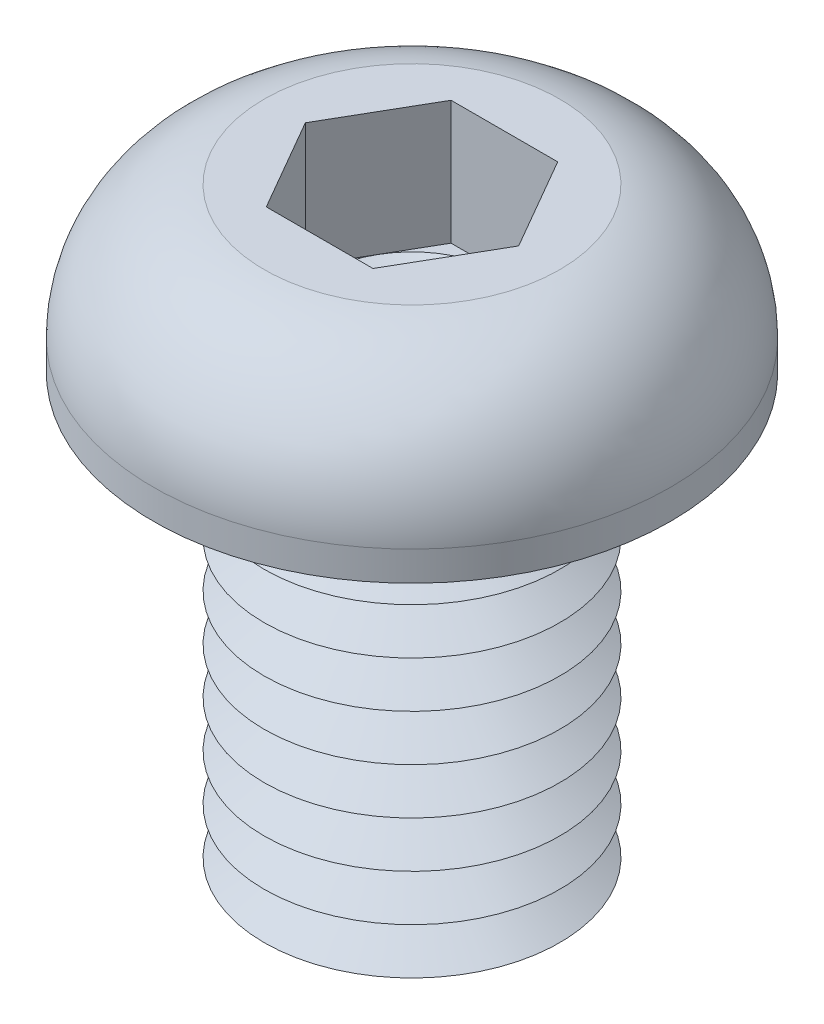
ISO-10303-21;
HEADER;
FILE_DESCRIPTION(('STEP AP214'),'2;1');
FILE_NAME('part.step','',(''),(''),'','','');
FILE_SCHEMA(('AUTOMOTIVE_DESIGN { 1 0 10303 214 1 1 1 1 }'));
ENDSEC;
DATA;
#1=APPLICATION_CONTEXT('core data for automotive mechanical design processes');
#2=APPLICATION_PROTOCOL_DEFINITION('international standard','automotive_design',2000,#1);
#3=PRODUCT_CONTEXT('',#1,'mechanical');
#4=PRODUCT('Part','Part','',(#3));
#5=PRODUCT_RELATED_PRODUCT_CATEGORY('part','',(#4));
#6=PRODUCT_DEFINITION_FORMATION('','',#4);
#7=PRODUCT_DEFINITION_CONTEXT('part definition',#1,'design');
#8=PRODUCT_DEFINITION('design','',#6,#7);
#9=PRODUCT_DEFINITION_SHAPE('','',#8);
#10=(LENGTH_UNIT() NAMED_UNIT(*) SI_UNIT(.MILLI.,.METRE.));
#11=(NAMED_UNIT(*) PLANE_ANGLE_UNIT() SI_UNIT($,.RADIAN.));
#12=(NAMED_UNIT(*) SI_UNIT($,.STERADIAN.) SOLID_ANGLE_UNIT());
#13=UNCERTAINTY_MEASURE_WITH_UNIT(LENGTH_MEASURE(1.E-05),#10,'distance_accuracy_value','');
#14=(GEOMETRIC_REPRESENTATION_CONTEXT(3) GLOBAL_UNCERTAINTY_ASSIGNED_CONTEXT((#13)) GLOBAL_UNIT_ASSIGNED_CONTEXT((#10,
#11,#12)) REPRESENTATION_CONTEXT('',''));
#15=CARTESIAN_POINT('',(0.,0.,0.));
#16=DIRECTION('',(0.,0.,1.));
#17=DIRECTION('',(1.,0.,0.));
#18=AXIS2_PLACEMENT_3D('',#15,#16,#17);
#19=CARTESIAN_POINT('',(0.,0.,0.));
#20=DIRECTION('',(0.,-1.,0.));
#21=DIRECTION('',(0.,0.,-1.));
#22=AXIS2_PLACEMENT_3D('',#19,#20,#21);
#23=TOROIDAL_SURFACE('',#22,4.625,0.625);
#24=CARTESIAN_POINT('',(0.,0.,-5.25));
#25=VERTEX_POINT('',#24);
#26=VERTEX_LOOP('',#25);
#27=FACE_BOUND('',#26,.T.);
#28=ADVANCED_FACE('P0_F12',(#27),#23,.T.);
#29=CLOSED_SHELL('',(#28));
#30=MANIFOLD_SOLID_BREP('P0_B1',#29);
#31=CARTESIAN_POINT('',(1.44337567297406,1.05,-2.5));
#32=DIRECTION('',(0.,1.,0.));
#33=DIRECTION('',(0.,0.,1.));
#34=AXIS2_PLACEMENT_3D('',#31,#32,#33);
#35=PLANE('',#34);
#36=CARTESIAN_POINT('',(0.,1.05,0.));
#37=DIRECTION('',(0.,1.,0.));
#38=DIRECTION('',(0.,0.,1.));
#39=AXIS2_PLACEMENT_3D('',#36,#37,#38);
#40=CIRCLE('',#39,2.5);
#41=CARTESIAN_POINT('',(0.,1.05,2.5));
#42=VERTEX_POINT('',#41);
#43=CARTESIAN_POINT('',(2.1650635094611,1.05,1.25));
#44=VERTEX_POINT('',#43);
#45=EDGE_CURVE('P1_E93',#42,#44,#40,.T.);
#46=ORIENTED_EDGE('',*,*,#45,.F.);
#47=DIRECTION('',(1.,0.,0.));
#48=VECTOR('',#47,1.);
#49=CARTESIAN_POINT('',(-1.44337567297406,1.05,2.5));
#50=LINE('',#49,#48);
#51=CARTESIAN_POINT('',(1.44337567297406,1.05,2.5));
#52=VERTEX_POINT('',#51);
#53=EDGE_CURVE('P1_E116',#42,#52,#50,.T.);
#54=ORIENTED_EDGE('',*,*,#53,.T.);
#55=DIRECTION('',(0.5,0.,-0.866025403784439));
#56=VECTOR('',#55,1.);
#57=CARTESIAN_POINT('',(1.44337567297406,1.05,2.5));
#58=LINE('',#57,#56);
#59=EDGE_CURVE('P1_E112',#52,#44,#58,.T.);
#60=ORIENTED_EDGE('',*,*,#59,.T.);
#61=EDGE_LOOP('',(#46,#54,#60));
#62=FACE_BOUND('',#61,.T.);
#63=ADVANCED_FACE('P1_F15',(#62),#35,.T.);
#64=CARTESIAN_POINT('',(0.,1.05,0.));
#65=DIRECTION('',(0.,1.,0.));
#66=DIRECTION('',(0.,0.,1.));
#67=AXIS2_PLACEMENT_3D('',#64,#65,#66);
#68=CIRCLE('',#67,2.5);
#69=CARTESIAN_POINT('',(2.1650635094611,1.05,-1.25));
#70=VERTEX_POINT('',#69);
#71=EDGE_CURVE('P1_E10',#44,#70,#68,.T.);
#72=ORIENTED_EDGE('',*,*,#71,.F.);
#73=CARTESIAN_POINT('',(2.88675134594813,1.05,0.));
#74=VERTEX_POINT('',#73);
#75=EDGE_CURVE('P1_E104',#44,#74,#58,.T.);
#76=ORIENTED_EDGE('',*,*,#75,.T.);
#77=DIRECTION('',(-0.5,0.,-0.866025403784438));
#78=VECTOR('',#77,1.);
#79=CARTESIAN_POINT('',(2.88675134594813,1.05,0.));
#80=LINE('',#79,#78);
#81=EDGE_CURVE('P1_E107',#74,#70,#80,.T.);
#82=ORIENTED_EDGE('',*,*,#81,.T.);
#83=EDGE_LOOP('',(#72,#76,#82));
#84=FACE_BOUND('',#83,.T.);
#85=ADVANCED_FACE('P1_F103',(#84),#35,.T.);
#86=CARTESIAN_POINT('',(0.,1.05,-2.5));
#87=VERTEX_POINT('',#86);
#88=EDGE_CURVE('P1_E24',#70,#87,#68,.T.);
#89=ORIENTED_EDGE('',*,*,#88,.F.);
#90=CARTESIAN_POINT('',(1.44337567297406,1.05,-2.5));
#91=VERTEX_POINT('',#90);
#92=EDGE_CURVE('P1_E139',#70,#91,#80,.T.);
#93=ORIENTED_EDGE('',*,*,#92,.T.);
#94=DIRECTION('',(-1.,0.,0.));
#95=VECTOR('',#94,1.);
#96=CARTESIAN_POINT('',(1.44337567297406,1.05,-2.5));
#97=LINE('',#96,#95);
#98=EDGE_CURVE('P1_E276',#91,#87,#97,.T.);
#99=ORIENTED_EDGE('',*,*,#98,.T.);
#100=EDGE_LOOP('',(#89,#93,#99));
#101=FACE_BOUND('',#100,.T.);
#102=ADVANCED_FACE('P1_F241',(#101),#35,.T.);
#103=CARTESIAN_POINT('',(-2.1650635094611,1.05,-1.25));
#104=VERTEX_POINT('',#103);
#105=EDGE_CURVE('P1_E271',#87,#104,#68,.T.);
#106=ORIENTED_EDGE('',*,*,#105,.F.);
#107=CARTESIAN_POINT('',(-1.44337567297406,1.05,-2.5));
#108=VERTEX_POINT('',#107);
#109=EDGE_CURVE('P1_E280',#87,#108,#97,.T.);
#110=ORIENTED_EDGE('',*,*,#109,.T.);
#111=DIRECTION('',(-0.5,0.,0.866025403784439));
#112=VECTOR('',#111,1.);
#113=CARTESIAN_POINT('',(-1.44337567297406,1.05,-2.5));
#114=LINE('',#113,#112);
#115=EDGE_CURVE('P1_E275',#108,#104,#114,.T.);
#116=ORIENTED_EDGE('',*,*,#115,.T.);
#117=EDGE_LOOP('',(#106,#110,#116));
#118=FACE_BOUND('',#117,.T.);
#119=ADVANCED_FACE('P1_F255',(#118),#35,.T.);
#120=CARTESIAN_POINT('',(-2.1650635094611,1.05,1.25));
#121=VERTEX_POINT('',#120);
#122=EDGE_CURVE('P1_E31',#104,#121,#68,.T.);
#123=ORIENTED_EDGE('',*,*,#122,.F.);
#124=CARTESIAN_POINT('',(-2.88675134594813,1.05,0.));
#125=VERTEX_POINT('',#124);
#126=EDGE_CURVE('P1_E267',#104,#125,#114,.T.);
#127=ORIENTED_EDGE('',*,*,#126,.T.);
#128=DIRECTION('',(0.5,0.,0.866025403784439));
#129=VECTOR('',#128,1.);
#130=CARTESIAN_POINT('',(-2.88675134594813,1.05,0.));
#131=LINE('',#130,#129);
#132=EDGE_CURVE('P1_E270',#125,#121,#131,.T.);
#133=ORIENTED_EDGE('',*,*,#132,.T.);
#134=EDGE_LOOP('',(#123,#127,#133));
#135=FACE_BOUND('',#134,.T.);
#136=ADVANCED_FACE('P1_F246',(#135),#35,.T.);
#137=CARTESIAN_POINT('',(0.,-10.75,0.));
#138=DIRECTION('',(0.,1.,0.));
#139=DIRECTION('',(0.,0.,1.));
#140=AXIS2_PLACEMENT_3D('',#137,#138,#139);
#141=CONICAL_SURFACE('',#140,2.91746824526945,1.0471975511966);
#142=CARTESIAN_POINT('',(0.,-10.125,0.));
#143=DIRECTION('',(0.,-1.,0.));
#144=DIRECTION('',(0.,0.,-1.));
#145=AXIS2_PLACEMENT_3D('',#142,#143,#144);
#146=CIRCLE('',#145,4.);
#147=CARTESIAN_POINT('',(0.,-10.125,-4.));
#148=VERTEX_POINT('',#147);
#149=EDGE_CURVE('P1_E203',#148,#148,#146,.T.);
#150=ORIENTED_EDGE('',*,*,#149,.T.);
#151=EDGE_LOOP('',(#150));
#152=FACE_BOUND('',#151,.T.);
#153=CARTESIAN_POINT('',(0.,-10.75,0.));
#154=DIRECTION('',(0.,-1.,0.));
#155=DIRECTION('',(0.,0.,-1.));
#156=AXIS2_PLACEMENT_3D('',#153,#154,#155);
#157=CIRCLE('',#156,2.91746824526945);
#158=CARTESIAN_POINT('',(0.,-10.75,-2.91746824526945));
#159=VERTEX_POINT('',#158);
#160=EDGE_CURVE('P1_E206',#159,#159,#157,.T.);
#161=ORIENTED_EDGE('',*,*,#160,.F.);
#162=EDGE_LOOP('',(#161));
#163=FACE_BOUND('',#162,.T.);
#164=ADVANCED_FACE('P1_F254',(#152,#163),#141,.T.);
#165=CARTESIAN_POINT('',(0.,-11.375,0.));
#166=DIRECTION('',(0.,-1.,0.));
#167=DIRECTION('',(0.,0.,-1.));
#168=AXIS2_PLACEMENT_3D('',#165,#166,#167);
#169=CONICAL_SURFACE('',#168,4.,1.0471975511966);
#170=ORIENTED_EDGE('',*,*,#160,.T.);
#171=EDGE_LOOP('',(#170));
#172=FACE_BOUND('',#171,.T.);
#173=CARTESIAN_POINT('',(0.,-11.375,0.));
#174=DIRECTION('',(0.,-1.,0.));
#175=DIRECTION('',(0.,0.,-1.));
#176=AXIS2_PLACEMENT_3D('',#173,#174,#175);
#177=CIRCLE('',#176,4.);
#178=CARTESIAN_POINT('',(0.,-11.375,-4.));
#179=VERTEX_POINT('',#178);
#180=EDGE_CURVE('P1_E209',#179,#179,#177,.T.);
#181=ORIENTED_EDGE('',*,*,#180,.F.);
#182=EDGE_LOOP('',(#181));
#183=FACE_BOUND('',#182,.T.);
#184=ADVANCED_FACE('P1_F261',(#172,#183),#169,.T.);
#185=CARTESIAN_POINT('',(0.,-12.,0.));
#186=DIRECTION('',(0.,1.,0.));
#187=DIRECTION('',(0.,0.,1.));
#188=AXIS2_PLACEMENT_3D('',#185,#186,#187);
#189=PLANE('',#188);
#190=CARTESIAN_POINT('',(0.,-12.,0.));
#191=DIRECTION('',(0.,-1.,0.));
#192=DIRECTION('',(0.,0.,-1.));
#193=AXIS2_PLACEMENT_3D('',#190,#191,#192);
#194=CIRCLE('',#193,2.91746824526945);
#195=CARTESIAN_POINT('',(0.,-12.,-2.91746824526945));
#196=VERTEX_POINT('',#195);
#197=EDGE_CURVE('P1_E212',#196,#196,#194,.T.);
#198=ORIENTED_EDGE('',*,*,#197,.T.);
#199=EDGE_LOOP('',(#198));
#200=FACE_BOUND('',#199,.T.);
#201=ADVANCED_FACE('P1_F339',(#200),#189,.F.);
#202=CARTESIAN_POINT('',(0.,-12.,0.));
#203=DIRECTION('',(0.,1.,0.));
#204=DIRECTION('',(0.,0.,1.));
#205=AXIS2_PLACEMENT_3D('',#202,#203,#204);
#206=CONICAL_SURFACE('',#205,2.91746824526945,1.0471975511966);
#207=ORIENTED_EDGE('',*,*,#180,.T.);
#208=EDGE_LOOP('',(#207));
#209=FACE_BOUND('',#208,.T.);
#210=ORIENTED_EDGE('',*,*,#197,.F.);
#211=EDGE_LOOP('',(#210));
#212=FACE_BOUND('',#211,.T.);
#213=ADVANCED_FACE('P1_F350',(#209,#212),#206,.T.);
#214=CARTESIAN_POINT('',(0.,-9.5,0.));
#215=DIRECTION('',(0.,1.,0.));
#216=DIRECTION('',(0.,0.,1.));
#217=AXIS2_PLACEMENT_3D('',#214,#215,#216);
#218=CONICAL_SURFACE('',#217,2.91746824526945,1.0471975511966);
#219=CARTESIAN_POINT('',(0.,-8.875,0.));
#220=DIRECTION('',(0.,-1.,0.));
#221=DIRECTION('',(0.,0.,-1.));
#222=AXIS2_PLACEMENT_3D('',#219,#220,#221);
#223=CIRCLE('',#222,4.);
#224=CARTESIAN_POINT('',(0.,-8.875,-4.));
#225=VERTEX_POINT('',#224);
#226=EDGE_CURVE('P1_E197',#225,#225,#223,.T.);
#227=ORIENTED_EDGE('',*,*,#226,.T.);
#228=EDGE_LOOP('',(#227));
#229=FACE_BOUND('',#228,.T.);
#230=CARTESIAN_POINT('',(0.,-9.5,0.));
#231=DIRECTION('',(0.,-1.,0.));
#232=DIRECTION('',(0.,0.,-1.));
#233=AXIS2_PLACEMENT_3D('',#230,#231,#232);
#234=CIRCLE('',#233,2.91746824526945);
#235=CARTESIAN_POINT('',(0.,-9.5,-2.91746824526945));
#236=VERTEX_POINT('',#235);
#237=EDGE_CURVE('P1_E200',#236,#236,#234,.T.);
#238=ORIENTED_EDGE('',*,*,#237,.F.);
#239=EDGE_LOOP('',(#238));
#240=FACE_BOUND('',#239,.T.);
#241=ADVANCED_FACE('P1_F359',(#229,#240),#218,.T.);
#242=CARTESIAN_POINT('',(0.,-10.125,0.));
#243=DIRECTION('',(0.,-1.,0.));
#244=DIRECTION('',(0.,0.,-1.));
#245=AXIS2_PLACEMENT_3D('',#242,#243,#244);
#246=CONICAL_SURFACE('',#245,4.,1.0471975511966);
#247=ORIENTED_EDGE('',*,*,#237,.T.);
#248=EDGE_LOOP('',(#247));
#249=FACE_BOUND('',#248,.T.);
#250=ORIENTED_EDGE('',*,*,#149,.F.);
#251=EDGE_LOOP('',(#250));
#252=FACE_BOUND('',#251,.T.);
#253=ADVANCED_FACE('P1_F368',(#249,#252),#246,.T.);
#254=CARTESIAN_POINT('',(0.,-8.25,0.));
#255=DIRECTION('',(0.,1.,0.));
#256=DIRECTION('',(0.,0.,1.));
#257=AXIS2_PLACEMENT_3D('',#254,#255,#256);
#258=CONICAL_SURFACE('',#257,2.91746824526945,1.0471975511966);
#259=CARTESIAN_POINT('',(0.,-7.625,0.));
#260=DIRECTION('',(0.,-1.,0.));
#261=DIRECTION('',(0.,0.,-1.));
#262=AXIS2_PLACEMENT_3D('',#259,#260,#261);
#263=CIRCLE('',#262,4.);
#264=CARTESIAN_POINT('',(0.,-7.625,-4.));
#265=VERTEX_POINT('',#264);
#266=EDGE_CURVE('P1_E191',#265,#265,#263,.T.);
#267=ORIENTED_EDGE('',*,*,#266,.T.);
#268=EDGE_LOOP('',(#267));
#269=FACE_BOUND('',#268,.T.);
#270=CARTESIAN_POINT('',(0.,-8.25,0.));
#271=DIRECTION('',(0.,-1.,0.));
#272=DIRECTION('',(0.,0.,-1.));
#273=AXIS2_PLACEMENT_3D('',#270,#271,#272);
#274=CIRCLE('',#273,2.91746824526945);
#275=CARTESIAN_POINT('',(0.,-8.25,-2.91746824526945));
#276=VERTEX_POINT('',#275);
#277=EDGE_CURVE('P1_E194',#276,#276,#274,.T.);
#278=ORIENTED_EDGE('',*,*,#277,.F.);
#279=EDGE_LOOP('',(#278));
#280=FACE_BOUND('',#279,.T.);
#281=ADVANCED_FACE('P1_F378',(#269,#280),#258,.T.);
#282=CARTESIAN_POINT('',(0.,-8.875,0.));
#283=DIRECTION('',(0.,-1.,0.));
#284=DIRECTION('',(0.,0.,-1.));
#285=AXIS2_PLACEMENT_3D('',#282,#283,#284);
#286=CONICAL_SURFACE('',#285,4.,1.0471975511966);
#287=ORIENTED_EDGE('',*,*,#277,.T.);
#288=EDGE_LOOP('',(#287));
#289=FACE_BOUND('',#288,.T.);
#290=ORIENTED_EDGE('',*,*,#226,.F.);
#291=EDGE_LOOP('',(#290));
#292=FACE_BOUND('',#291,.T.);
#293=ADVANCED_FACE('P1_F388',(#289,#292),#286,.T.);
#294=CARTESIAN_POINT('',(0.,-7.,0.));
#295=DIRECTION('',(0.,1.,0.));
#296=DIRECTION('',(0.,0.,1.));
#297=AXIS2_PLACEMENT_3D('',#294,#295,#296);
#298=CONICAL_SURFACE('',#297,2.91746824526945,1.0471975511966);
#299=CARTESIAN_POINT('',(0.,-6.375,0.));
#300=DIRECTION('',(0.,-1.,0.));
#301=DIRECTION('',(0.,0.,-1.));
#302=AXIS2_PLACEMENT_3D('',#299,#300,#301);
#303=CIRCLE('',#302,4.);
#304=CARTESIAN_POINT('',(0.,-6.375,-4.));
#305=VERTEX_POINT('',#304);
#306=EDGE_CURVE('P1_E185',#305,#305,#303,.T.);
#307=ORIENTED_EDGE('',*,*,#306,.T.);
#308=EDGE_LOOP('',(#307));
#309=FACE_BOUND('',#308,.T.);
#310=CARTESIAN_POINT('',(0.,-7.,0.));
#311=DIRECTION('',(0.,-1.,0.));
#312=DIRECTION('',(0.,0.,-1.));
#313=AXIS2_PLACEMENT_3D('',#310,#311,#312);
#314=CIRCLE('',#313,2.91746824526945);
#315=CARTESIAN_POINT('',(0.,-7.,-2.91746824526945));
#316=VERTEX_POINT('',#315);
#317=EDGE_CURVE('P1_E188',#316,#316,#314,.T.);
#318=ORIENTED_EDGE('',*,*,#317,.F.);
#319=EDGE_LOOP('',(#318));
#320=FACE_BOUND('',#319,.T.);
#321=ADVANCED_FACE('P1_F398',(#309,#320),#298,.T.);
#322=CARTESIAN_POINT('',(0.,-7.625,0.));
#323=DIRECTION('',(0.,-1.,0.));
#324=DIRECTION('',(0.,0.,-1.));
#325=AXIS2_PLACEMENT_3D('',#322,#323,#324);
#326=CONICAL_SURFACE('',#325,4.,1.0471975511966);
#327=ORIENTED_EDGE('',*,*,#317,.T.);
#328=EDGE_LOOP('',(#327));
#329=FACE_BOUND('',#328,.T.);
#330=ORIENTED_EDGE('',*,*,#266,.F.);
#331=EDGE_LOOP('',(#330));
#332=FACE_BOUND('',#331,.T.);
#333=ADVANCED_FACE('P1_F408',(#329,#332),#326,.T.);
#334=CARTESIAN_POINT('',(0.,-5.75,0.));
#335=DIRECTION('',(0.,1.,0.));
#336=DIRECTION('',(0.,0.,1.));
#337=AXIS2_PLACEMENT_3D('',#334,#335,#336);
#338=CONICAL_SURFACE('',#337,2.91746824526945,1.0471975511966);
#339=CARTESIAN_POINT('',(0.,-5.125,0.));
#340=DIRECTION('',(0.,-1.,0.));
#341=DIRECTION('',(0.,0.,-1.));
#342=AXIS2_PLACEMENT_3D('',#339,#340,#341);
#343=CIRCLE('',#342,4.);
#344=CARTESIAN_POINT('',(0.,-5.125,-4.));
#345=VERTEX_POINT('',#344);
#346=EDGE_CURVE('P1_E179',#345,#345,#343,.T.);
#347=ORIENTED_EDGE('',*,*,#346,.T.);
#348=EDGE_LOOP('',(#347));
#349=FACE_BOUND('',#348,.T.);
#350=CARTESIAN_POINT('',(0.,-5.75,0.));
#351=DIRECTION('',(0.,-1.,0.));
#352=DIRECTION('',(0.,0.,-1.));
#353=AXIS2_PLACEMENT_3D('',#350,#351,#352);
#354=CIRCLE('',#353,2.91746824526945);
#355=CARTESIAN_POINT('',(0.,-5.75,-2.91746824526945));
#356=VERTEX_POINT('',#355);
#357=EDGE_CURVE('P1_E182',#356,#356,#354,.T.);
#358=ORIENTED_EDGE('',*,*,#357,.F.);
#359=EDGE_LOOP('',(#358));
#360=FACE_BOUND('',#359,.T.);
#361=ADVANCED_FACE('P1_F418',(#349,#360),#338,.T.);
#362=CARTESIAN_POINT('',(0.,-6.375,0.));
#363=DIRECTION('',(0.,-1.,0.));
#364=DIRECTION('',(0.,0.,-1.));
#365=AXIS2_PLACEMENT_3D('',#362,#363,#364);
#366=CONICAL_SURFACE('',#365,4.,1.0471975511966);
#367=ORIENTED_EDGE('',*,*,#357,.T.);
#368=EDGE_LOOP('',(#367));
#369=FACE_BOUND('',#368,.T.);
#370=ORIENTED_EDGE('',*,*,#306,.F.);
#371=EDGE_LOOP('',(#370));
#372=FACE_BOUND('',#371,.T.);
#373=ADVANCED_FACE('P1_F428',(#369,#372),#366,.T.);
#374=CARTESIAN_POINT('',(0.,-4.5,0.));
#375=DIRECTION('',(0.,1.,0.));
#376=DIRECTION('',(0.,0.,1.));
#377=AXIS2_PLACEMENT_3D('',#374,#375,#376);
#378=CONICAL_SURFACE('',#377,2.91746824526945,1.0471975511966);
#379=CARTESIAN_POINT('',(0.,-3.875,0.));
#380=DIRECTION('',(0.,-1.,0.));
#381=DIRECTION('',(0.,0.,-1.));
#382=AXIS2_PLACEMENT_3D('',#379,#380,#381);
#383=CIRCLE('',#382,4.);
#384=CARTESIAN_POINT('',(0.,-3.875,-4.));
#385=VERTEX_POINT('',#384);
#386=EDGE_CURVE('P1_E173',#385,#385,#383,.T.);
#387=ORIENTED_EDGE('',*,*,#386,.T.);
#388=EDGE_LOOP('',(#387));
#389=FACE_BOUND('',#388,.T.);
#390=CARTESIAN_POINT('',(0.,-4.5,0.));
#391=DIRECTION('',(0.,-1.,0.));
#392=DIRECTION('',(0.,0.,-1.));
#393=AXIS2_PLACEMENT_3D('',#390,#391,#392);
#394=CIRCLE('',#393,2.91746824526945);
#395=CARTESIAN_POINT('',(0.,-4.5,-2.91746824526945));
#396=VERTEX_POINT('',#395);
#397=EDGE_CURVE('P1_E176',#396,#396,#394,.T.);
#398=ORIENTED_EDGE('',*,*,#397,.F.);
#399=EDGE_LOOP('',(#398));
#400=FACE_BOUND('',#399,.T.);
#401=ADVANCED_FACE('P1_F438',(#389,#400),#378,.T.);
#402=CARTESIAN_POINT('',(0.,-5.125,0.));
#403=DIRECTION('',(0.,-1.,0.));
#404=DIRECTION('',(0.,0.,-1.));
#405=AXIS2_PLACEMENT_3D('',#402,#403,#404);
#406=CONICAL_SURFACE('',#405,4.,1.0471975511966);
#407=ORIENTED_EDGE('',*,*,#397,.T.);
#408=EDGE_LOOP('',(#407));
#409=FACE_BOUND('',#408,.T.);
#410=ORIENTED_EDGE('',*,*,#346,.F.);
#411=EDGE_LOOP('',(#410));
#412=FACE_BOUND('',#411,.T.);
#413=ADVANCED_FACE('P1_F448',(#409,#412),#406,.T.);
#414=CARTESIAN_POINT('',(0.,-3.25,0.));
#415=DIRECTION('',(0.,1.,0.));
#416=DIRECTION('',(0.,0.,1.));
#417=AXIS2_PLACEMENT_3D('',#414,#415,#416);
#418=CONICAL_SURFACE('',#417,2.91746824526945,1.0471975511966);
#419=CARTESIAN_POINT('',(0.,-2.625,0.));
#420=DIRECTION('',(0.,-1.,0.));
#421=DIRECTION('',(0.,0.,-1.));
#422=AXIS2_PLACEMENT_3D('',#419,#420,#421);
#423=CIRCLE('',#422,4.);
#424=CARTESIAN_POINT('',(0.,-2.625,-4.));
#425=VERTEX_POINT('',#424);
#426=EDGE_CURVE('P1_E164',#425,#425,#423,.T.);
#427=ORIENTED_EDGE('',*,*,#426,.T.);
#428=EDGE_LOOP('',(#427));
#429=FACE_BOUND('',#428,.T.);
#430=CARTESIAN_POINT('',(0.,-3.25,0.));
#431=DIRECTION('',(0.,-1.,0.));
#432=DIRECTION('',(0.,0.,-1.));
#433=AXIS2_PLACEMENT_3D('',#430,#431,#432);
#434=CIRCLE('',#433,2.91746824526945);
#435=CARTESIAN_POINT('',(0.,-3.25,-2.91746824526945));
#436=VERTEX_POINT('',#435);
#437=EDGE_CURVE('P1_E170',#436,#436,#434,.T.);
#438=ORIENTED_EDGE('',*,*,#437,.F.);
#439=EDGE_LOOP('',(#438));
#440=FACE_BOUND('',#439,.T.);
#441=ADVANCED_FACE('P1_F458',(#429,#440),#418,.T.);
#442=CARTESIAN_POINT('',(0.,-3.875,0.));
#443=DIRECTION('',(0.,-1.,0.));
#444=DIRECTION('',(0.,0.,-1.));
#445=AXIS2_PLACEMENT_3D('',#442,#443,#444);
#446=CONICAL_SURFACE('',#445,4.,1.0471975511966);
#447=ORIENTED_EDGE('',*,*,#437,.T.);
#448=EDGE_LOOP('',(#447));
#449=FACE_BOUND('',#448,.T.);
#450=ORIENTED_EDGE('',*,*,#386,.F.);
#451=EDGE_LOOP('',(#450));
#452=FACE_BOUND('',#451,.T.);
#453=ADVANCED_FACE('P1_F468',(#449,#452),#446,.T.);
#454=CARTESIAN_POINT('',(0.,-2.,0.));
#455=DIRECTION('',(0.,1.,0.));
#456=DIRECTION('',(0.,0.,1.));
#457=AXIS2_PLACEMENT_3D('',#454,#455,#456);
#458=CONICAL_SURFACE('',#457,2.91746824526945,1.0471975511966);
#459=CARTESIAN_POINT('',(0.,-1.375,0.));
#460=DIRECTION('',(0.,-1.,0.));
#461=DIRECTION('',(0.,0.,-1.));
#462=AXIS2_PLACEMENT_3D('',#459,#460,#461);
#463=CIRCLE('',#462,4.);
#464=CARTESIAN_POINT('',(0.,-1.375,-4.));
#465=VERTEX_POINT('',#464);
#466=EDGE_CURVE('P1_E167',#465,#465,#463,.T.);
#467=ORIENTED_EDGE('',*,*,#466,.T.);
#468=EDGE_LOOP('',(#467));
#469=FACE_BOUND('',#468,.T.);
#470=CARTESIAN_POINT('',(0.,-2.,0.));
#471=DIRECTION('',(0.,-1.,0.));
#472=DIRECTION('',(0.,0.,-1.));
#473=AXIS2_PLACEMENT_3D('',#470,#471,#472);
#474=CIRCLE('',#473,2.91746824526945);
#475=CARTESIAN_POINT('',(0.,-2.,-2.91746824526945));
#476=VERTEX_POINT('',#475);
#477=EDGE_CURVE('P1_E161',#476,#476,#474,.T.);
#478=ORIENTED_EDGE('',*,*,#477,.F.);
#479=EDGE_LOOP('',(#478));
#480=FACE_BOUND('',#479,.T.);
#481=ADVANCED_FACE('P1_F478',(#469,#480),#458,.T.);
#482=CARTESIAN_POINT('',(0.,-2.625,0.));
#483=DIRECTION('',(0.,-1.,0.));
#484=DIRECTION('',(0.,0.,-1.));
#485=AXIS2_PLACEMENT_3D('',#482,#483,#484);
#486=CONICAL_SURFACE('',#485,4.,1.0471975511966);
#487=ORIENTED_EDGE('',*,*,#477,.T.);
#488=EDGE_LOOP('',(#487));
#489=FACE_BOUND('',#488,.T.);
#490=ORIENTED_EDGE('',*,*,#426,.F.);
#491=EDGE_LOOP('',(#490));
#492=FACE_BOUND('',#491,.T.);
#493=ADVANCED_FACE('P1_F488',(#489,#492),#486,.T.);
#494=CARTESIAN_POINT('',(0.,-12.,0.));
#495=DIRECTION('',(0.,1.,0.));
#496=DIRECTION('',(0.,0.,1.));
#497=AXIS2_PLACEMENT_3D('',#494,#495,#496);
#498=CYLINDRICAL_SURFACE('',#497,4.);
#499=CARTESIAN_POINT('',(0.,0.,0.));
#500=DIRECTION('',(0.,-1.,0.));
#501=DIRECTION('',(1.,0.,0.));
#502=AXIS2_PLACEMENT_3D('',#499,#500,#501);
#503=CIRCLE('',#502,4.);
#504=CARTESIAN_POINT('',(4.,0.,0.));
#505=VERTEX_POINT('',#504);
#506=EDGE_CURVE('P1_E141',#505,#505,#503,.F.);
#507=ORIENTED_EDGE('',*,*,#506,.F.);
#508=EDGE_LOOP('',(#507));
#509=FACE_BOUND('',#508,.T.);
#510=ORIENTED_EDGE('',*,*,#466,.F.);
#511=EDGE_LOOP('',(#510));
#512=FACE_BOUND('',#511,.T.);
#513=ADVANCED_FACE('P1_F17',(#509,#512),#498,.T.);
#514=CARTESIAN_POINT('',(0.,0.,0.));
#515=DIRECTION('',(0.,-1.,0.));
#516=DIRECTION('',(0.,0.,-1.));
#517=AXIS2_PLACEMENT_3D('',#514,#515,#516);
#518=TOROIDAL_SURFACE('',#517,4.625,0.625);
#519=ORIENTED_EDGE('',*,*,#506,.T.);
#520=EDGE_LOOP('',(#519));
#521=FACE_BOUND('',#520,.T.);
#522=CARTESIAN_POINT('',(0.,0.,0.));
#523=DIRECTION('',(0.,1.,0.));
#524=DIRECTION('',(-1.,0.,0.));
#525=AXIS2_PLACEMENT_3D('',#522,#523,#524);
#526=CIRCLE('',#525,5.25);
#527=CARTESIAN_POINT('',(-5.25,0.,0.));
#528=VERTEX_POINT('',#527);
#529=EDGE_CURVE('P1_E151',#528,#528,#526,.F.);
#530=ORIENTED_EDGE('',*,*,#529,.T.);
#531=EDGE_LOOP('',(#530));
#532=FACE_BOUND('',#531,.T.);
#533=ADVANCED_FACE('P1_F217',(#521,#532),#518,.F.);
#534=CARTESIAN_POINT('',(4.,4.4,0.));
#535=DIRECTION('',(0.,-1.,0.));
#536=DIRECTION('',(1.,0.,0.));
#537=AXIS2_PLACEMENT_3D('',#534,#535,#536);
#538=PLANE('',#537);
#539=DIRECTION('',(-1.,0.,0.));
#540=VECTOR('',#539,1.);
#541=CARTESIAN_POINT('',(1.44337567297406,4.4,-2.5));
#542=LINE('',#541,#540);
#543=CARTESIAN_POINT('',(1.44337567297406,4.4,-2.5));
#544=VERTEX_POINT('',#543);
#545=CARTESIAN_POINT('',(-1.44337567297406,4.4,-2.5));
#546=VERTEX_POINT('',#545);
#547=EDGE_CURVE('P1_E125',#544,#546,#542,.T.);
#548=ORIENTED_EDGE('',*,*,#547,.F.);
#549=DIRECTION('',(-0.5,0.,-0.866025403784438));
#550=VECTOR('',#549,1.);
#551=CARTESIAN_POINT('',(2.88675134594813,4.4,0.));
#552=LINE('',#551,#550);
#553=CARTESIAN_POINT('',(2.88675134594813,4.4,0.));
#554=VERTEX_POINT('',#553);
#555=EDGE_CURVE('P1_E39',#554,#544,#552,.T.);
#556=ORIENTED_EDGE('',*,*,#555,.F.);
#557=DIRECTION('',(0.5,0.,-0.866025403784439));
#558=VECTOR('',#557,1.);
#559=CARTESIAN_POINT('',(1.44337567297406,4.4,2.5));
#560=LINE('',#559,#558);
#561=CARTESIAN_POINT('',(1.44337567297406,4.4,2.5));
#562=VERTEX_POINT('',#561);
#563=EDGE_CURVE('P1_E137',#562,#554,#560,.T.);
#564=ORIENTED_EDGE('',*,*,#563,.F.);
#565=DIRECTION('',(1.,0.,0.));
#566=VECTOR('',#565,1.);
#567=CARTESIAN_POINT('',(-1.44337567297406,4.4,2.5));
#568=LINE('',#567,#566);
#569=CARTESIAN_POINT('',(-1.44337567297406,4.4,2.5));
#570=VERTEX_POINT('',#569);
#571=EDGE_CURVE('P1_E134',#570,#562,#568,.T.);
#572=ORIENTED_EDGE('',*,*,#571,.F.);
#573=DIRECTION('',(0.5,0.,0.866025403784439));
#574=VECTOR('',#573,1.);
#575=CARTESIAN_POINT('',(-2.88675134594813,4.4,0.));
#576=LINE('',#575,#574);
#577=CARTESIAN_POINT('',(-2.88675134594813,4.4,0.));
#578=VERTEX_POINT('',#577);
#579=EDGE_CURVE('P1_E131',#578,#570,#576,.T.);
#580=ORIENTED_EDGE('',*,*,#579,.F.);
#581=DIRECTION('',(-0.5,0.,0.866025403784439));
#582=VECTOR('',#581,1.);
#583=CARTESIAN_POINT('',(-1.44337567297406,4.4,-2.5));
#584=LINE('',#583,#582);
#585=EDGE_CURVE('P1_E128',#546,#578,#584,.T.);
#586=ORIENTED_EDGE('',*,*,#585,.F.);
#587=EDGE_LOOP('',(#548,#556,#564,#572,#580,#586));
#588=FACE_BOUND('',#587,.T.);
#589=CARTESIAN_POINT('',(0.,4.4,0.));
#590=DIRECTION('',(0.,1.,0.));
#591=DIRECTION('',(-1.,0.,0.));
#592=AXIS2_PLACEMENT_3D('',#589,#590,#591);
#593=CIRCLE('',#592,4.);
#594=CARTESIAN_POINT('',(-4.,4.4,0.));
#595=VERTEX_POINT('',#594);
#596=EDGE_CURVE('P1_E152',#595,#595,#593,.T.);
#597=ORIENTED_EDGE('',*,*,#596,.T.);
#598=EDGE_LOOP('',(#597));
#599=FACE_BOUND('',#598,.T.);
#600=ADVANCED_FACE('P1_F295',(#588,#599),#538,.F.);
#601=CARTESIAN_POINT('',(0.,0.8,0.));
#602=DIRECTION('',(0.,1.,0.));
#603=DIRECTION('',(-1.,0.,0.));
#604=AXIS2_PLACEMENT_3D('',#601,#602,#603);
#605=DEGENERATE_TOROIDAL_SURFACE('',#604,3.34,3.66,.T.);
#606=ORIENTED_EDGE('',*,*,#596,.F.);
#607=EDGE_LOOP('',(#606));
#608=FACE_BOUND('',#607,.T.);
#609=CARTESIAN_POINT('',(0.,0.799999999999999,0.));
#610=DIRECTION('',(0.,1.,0.));
#611=DIRECTION('',(-1.,0.,0.));
#612=AXIS2_PLACEMENT_3D('',#609,#610,#611);
#613=CIRCLE('',#612,7.);
#614=CARTESIAN_POINT('',(-7.,0.799999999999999,0.));
#615=VERTEX_POINT('',#614);
#616=EDGE_CURVE('P1_E155',#615,#615,#613,.T.);
#617=ORIENTED_EDGE('',*,*,#616,.T.);
#618=EDGE_LOOP('',(#617));
#619=FACE_BOUND('',#618,.T.);
#620=ADVANCED_FACE('P1_F231',(#608,#619),#605,.T.);
#621=CARTESIAN_POINT('',(0.,4.4,0.));
#622=DIRECTION('',(0.,1.,0.));
#623=DIRECTION('',(-1.,0.,0.));
#624=AXIS2_PLACEMENT_3D('',#621,#622,#623);
#625=CYLINDRICAL_SURFACE('',#624,7.);
#626=ORIENTED_EDGE('',*,*,#616,.F.);
#627=EDGE_LOOP('',(#626));
#628=FACE_BOUND('',#627,.T.);
#629=CARTESIAN_POINT('',(0.,0.,0.));
#630=DIRECTION('',(0.,1.,0.));
#631=DIRECTION('',(-1.,0.,0.));
#632=AXIS2_PLACEMENT_3D('',#629,#630,#631);
#633=CIRCLE('',#632,7.);
#634=CARTESIAN_POINT('',(-7.,0.,0.));
#635=VERTEX_POINT('',#634);
#636=EDGE_CURVE('P1_E158',#635,#635,#633,.T.);
#637=ORIENTED_EDGE('',*,*,#636,.T.);
#638=EDGE_LOOP('',(#637));
#639=FACE_BOUND('',#638,.T.);
#640=ADVANCED_FACE('P1_F222',(#628,#639),#625,.T.);
#641=CARTESIAN_POINT('',(0.,0.,0.));
#642=DIRECTION('',(0.,1.,0.));
#643=DIRECTION('',(-1.,0.,0.));
#644=AXIS2_PLACEMENT_3D('',#641,#642,#643);
#645=PLANE('',#644);
#646=ORIENTED_EDGE('',*,*,#636,.F.);
#647=EDGE_LOOP('',(#646));
#648=FACE_BOUND('',#647,.T.);
#649=ORIENTED_EDGE('',*,*,#529,.F.);
#650=EDGE_LOOP('',(#649));
#651=FACE_BOUND('',#650,.T.);
#652=ADVANCED_FACE('P1_F219',(#648,#651),#645,.F.);
#653=CARTESIAN_POINT('',(2.88675134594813,1.05,0.));
#654=DIRECTION('',(0.866025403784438,0.,-0.5));
#655=DIRECTION('',(-0.5,0.,-0.866025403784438));
#656=AXIS2_PLACEMENT_3D('',#653,#654,#655);
#657=PLANE('',#656);
#658=ORIENTED_EDGE('',*,*,#555,.T.);
#659=DIRECTION('',(0.,1.,0.));
#660=VECTOR('',#659,1.);
#661=CARTESIAN_POINT('',(1.44337567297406,1.05,-2.5));
#662=LINE('',#661,#660);
#663=EDGE_CURVE('P1_E118',#91,#544,#662,.T.);
#664=ORIENTED_EDGE('',*,*,#663,.F.);
#665=ORIENTED_EDGE('',*,*,#92,.F.);
#666=ORIENTED_EDGE('',*,*,#81,.F.);
#667=DIRECTION('',(0.,1.,0.));
#668=VECTOR('',#667,1.);
#669=CARTESIAN_POINT('',(2.88675134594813,1.05,0.));
#670=LINE('',#669,#668);
#671=EDGE_CURVE('P1_E113',#74,#554,#670,.T.);
#672=ORIENTED_EDGE('',*,*,#671,.T.);
#673=EDGE_LOOP('',(#658,#664,#665,#666,#672));
#674=FACE_BOUND('',#673,.T.);
#675=ADVANCED_FACE('P1_F221',(#674),#657,.F.);
#676=CARTESIAN_POINT('',(1.44337567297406,1.05,2.5));
#677=DIRECTION('',(0.866025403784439,0.,0.5));
#678=DIRECTION('',(0.5,0.,-0.866025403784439));
#679=AXIS2_PLACEMENT_3D('',#676,#677,#678);
#680=PLANE('',#679);
#681=ORIENTED_EDGE('',*,*,#563,.T.);
#682=ORIENTED_EDGE('',*,*,#671,.F.);
#683=ORIENTED_EDGE('',*,*,#75,.F.);
#684=ORIENTED_EDGE('',*,*,#59,.F.);
#685=DIRECTION('',(0.,1.,0.));
#686=VECTOR('',#685,1.);
#687=CARTESIAN_POINT('',(1.44337567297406,1.05,2.5));
#688=LINE('',#687,#686);
#689=EDGE_CURVE('P1_E142',#52,#562,#688,.T.);
#690=ORIENTED_EDGE('',*,*,#689,.T.);
#691=EDGE_LOOP('',(#681,#682,#683,#684,#690));
#692=FACE_BOUND('',#691,.T.);
#693=ADVANCED_FACE('P1_F111',(#692),#680,.F.);
#694=CARTESIAN_POINT('',(-1.44337567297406,1.05,2.5));
#695=DIRECTION('',(0.,0.,1.));
#696=DIRECTION('',(1.,0.,0.));
#697=AXIS2_PLACEMENT_3D('',#694,#695,#696);
#698=PLANE('',#697);
#699=ORIENTED_EDGE('',*,*,#571,.T.);
#700=ORIENTED_EDGE('',*,*,#689,.F.);
#701=ORIENTED_EDGE('',*,*,#53,.F.);
#702=CARTESIAN_POINT('',(-1.44337567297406,1.05,2.5));
#703=VERTEX_POINT('',#702);
#704=EDGE_CURVE('P1_E114',#703,#42,#50,.T.);
#705=ORIENTED_EDGE('',*,*,#704,.F.);
#706=DIRECTION('',(0.,1.,0.));
#707=VECTOR('',#706,1.);
#708=CARTESIAN_POINT('',(-1.44337567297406,1.05,2.5));
#709=LINE('',#708,#707);
#710=EDGE_CURVE('P1_E144',#703,#570,#709,.T.);
#711=ORIENTED_EDGE('',*,*,#710,.T.);
#712=EDGE_LOOP('',(#699,#700,#701,#705,#711));
#713=FACE_BOUND('',#712,.T.);
#714=ADVANCED_FACE('P1_F290',(#713),#698,.F.);
#715=CARTESIAN_POINT('',(-2.88675134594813,1.05,0.));
#716=DIRECTION('',(-0.866025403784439,0.,0.5));
#717=DIRECTION('',(0.5,0.,0.866025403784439));
#718=AXIS2_PLACEMENT_3D('',#715,#716,#717);
#719=PLANE('',#718);
#720=ORIENTED_EDGE('',*,*,#579,.T.);
#721=ORIENTED_EDGE('',*,*,#710,.F.);
#722=EDGE_CURVE('P1_E282',#121,#703,#131,.T.);
#723=ORIENTED_EDGE('',*,*,#722,.F.);
#724=ORIENTED_EDGE('',*,*,#132,.F.);
#725=DIRECTION('',(0.,1.,0.));
#726=VECTOR('',#725,1.);
#727=CARTESIAN_POINT('',(-2.88675134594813,1.05,0.));
#728=LINE('',#727,#726);
#729=EDGE_CURVE('P1_E146',#125,#578,#728,.T.);
#730=ORIENTED_EDGE('',*,*,#729,.T.);
#731=EDGE_LOOP('',(#720,#721,#723,#724,#730));
#732=FACE_BOUND('',#731,.T.);
#733=ADVANCED_FACE('P1_F566',(#732),#719,.F.);
#734=CARTESIAN_POINT('',(-1.44337567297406,1.05,-2.5));
#735=DIRECTION('',(-0.866025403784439,0.,-0.5));
#736=DIRECTION('',(-0.5,0.,0.866025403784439));
#737=AXIS2_PLACEMENT_3D('',#734,#735,#736);
#738=PLANE('',#737);
#739=ORIENTED_EDGE('',*,*,#585,.T.);
#740=ORIENTED_EDGE('',*,*,#729,.F.);
#741=ORIENTED_EDGE('',*,*,#126,.F.);
#742=ORIENTED_EDGE('',*,*,#115,.F.);
#743=DIRECTION('',(0.,1.,0.));
#744=VECTOR('',#743,1.);
#745=CARTESIAN_POINT('',(-1.44337567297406,1.05,-2.5));
#746=LINE('',#745,#744);
#747=EDGE_CURVE('P1_E119',#108,#546,#746,.T.);
#748=ORIENTED_EDGE('',*,*,#747,.T.);
#749=EDGE_LOOP('',(#739,#740,#741,#742,#748));
#750=FACE_BOUND('',#749,.T.);
#751=ADVANCED_FACE('P1_F250',(#750),#738,.F.);
#752=CARTESIAN_POINT('',(1.44337567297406,1.05,-2.5));
#753=DIRECTION('',(0.,0.,-1.));
#754=DIRECTION('',(-1.,0.,0.));
#755=AXIS2_PLACEMENT_3D('',#752,#753,#754);
#756=PLANE('',#755);
#757=ORIENTED_EDGE('',*,*,#547,.T.);
#758=ORIENTED_EDGE('',*,*,#747,.F.);
#759=ORIENTED_EDGE('',*,*,#109,.F.);
#760=ORIENTED_EDGE('',*,*,#98,.F.);
#761=ORIENTED_EDGE('',*,*,#663,.T.);
#762=EDGE_LOOP('',(#757,#758,#759,#760,#761));
#763=FACE_BOUND('',#762,.T.);
#764=ADVANCED_FACE('P1_F244',(#763),#756,.F.);
#765=EDGE_CURVE('P1_E19',#121,#42,#68,.T.);
#766=ORIENTED_EDGE('',*,*,#765,.F.);
#767=ORIENTED_EDGE('',*,*,#722,.T.);
#768=ORIENTED_EDGE('',*,*,#704,.T.);
#769=EDGE_LOOP('',(#766,#767,#768));
#770=FACE_BOUND('',#769,.T.);
#771=ADVANCED_FACE('P1_F90',(#770),#35,.T.);
#772=CARTESIAN_POINT('',(0.,1.05,0.));
#773=DIRECTION('',(0.,1.,0.));
#774=DIRECTION('',(0.,0.,1.));
#775=AXIS2_PLACEMENT_3D('',#772,#773,#774);
#776=CONICAL_SURFACE('',#775,2.5,1.0471975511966);
#777=CARTESIAN_POINT('',(0.,-0.393375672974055,0.));
#778=VERTEX_POINT('',#777);
#779=VERTEX_LOOP('',#778);
#780=FACE_BOUND('',#779,.T.);
#781=ORIENTED_EDGE('',*,*,#45,.T.);
#782=ORIENTED_EDGE('',*,*,#71,.T.);
#783=ORIENTED_EDGE('',*,*,#88,.T.);
#784=ORIENTED_EDGE('',*,*,#105,.T.);
#785=ORIENTED_EDGE('',*,*,#122,.T.);
#786=ORIENTED_EDGE('',*,*,#765,.T.);
#787=EDGE_LOOP('',(#781,#782,#783,#784,#785,#786));
#788=FACE_BOUND('',#787,.T.);
#789=ADVANCED_FACE('P1_F88',(#780,#788),#776,.F.);
#790=CLOSED_SHELL('',(#63,#85,#102,#119,#136,#164,#184,#201,#213,#241,#253,#281,#293,#321,#333,
#361,#373,#401,#413,#441,#453,#481,#493,#513,#533,#600,#620,#640,#652,#675,#693,#714,#733,#751,
#764,#771,#789));
#791=MANIFOLD_SOLID_BREP('P1_B1',#790);
#792=ADVANCED_BREP_SHAPE_REPRESENTATION('',(#18,#30,#791),#14);
#793=SHAPE_DEFINITION_REPRESENTATION(#9,#792);
ENDSEC;
END-ISO-10303-21;
